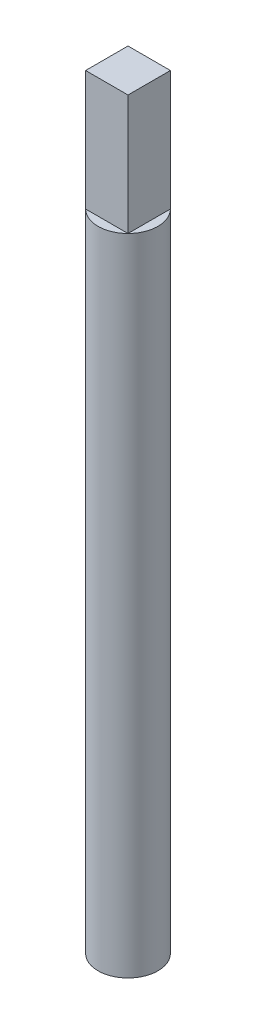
ISO-10303-21;
HEADER;
FILE_DESCRIPTION(('STEP AP214'),'2;1');
FILE_NAME('part.step','',(''),(''),'','','');
FILE_SCHEMA(('AUTOMOTIVE_DESIGN { 1 0 10303 214 1 1 1 1 }'));
ENDSEC;
DATA;
#1=APPLICATION_CONTEXT('core data for automotive mechanical design processes');
#2=APPLICATION_PROTOCOL_DEFINITION('international standard','automotive_design',2000,#1);
#3=PRODUCT_CONTEXT('',#1,'mechanical');
#4=PRODUCT('Part','Part','',(#3));
#5=PRODUCT_RELATED_PRODUCT_CATEGORY('part','',(#4));
#6=PRODUCT_DEFINITION_FORMATION('','',#4);
#7=PRODUCT_DEFINITION_CONTEXT('part definition',#1,'design');
#8=PRODUCT_DEFINITION('design','',#6,#7);
#9=PRODUCT_DEFINITION_SHAPE('','',#8);
#10=(LENGTH_UNIT() NAMED_UNIT(*) SI_UNIT(.MILLI.,.METRE.));
#11=(NAMED_UNIT(*) PLANE_ANGLE_UNIT() SI_UNIT($,.RADIAN.));
#12=(NAMED_UNIT(*) SI_UNIT($,.STERADIAN.) SOLID_ANGLE_UNIT());
#13=UNCERTAINTY_MEASURE_WITH_UNIT(LENGTH_MEASURE(1.E-05),#10,'distance_accuracy_value','');
#14=(GEOMETRIC_REPRESENTATION_CONTEXT(3) GLOBAL_UNCERTAINTY_ASSIGNED_CONTEXT((#13)) GLOBAL_UNIT_ASSIGNED_CONTEXT((#10,
#11,#12)) REPRESENTATION_CONTEXT('',''));
#15=CARTESIAN_POINT('',(0.,0.,0.));
#16=DIRECTION('',(0.,0.,1.));
#17=DIRECTION('',(1.,0.,0.));
#18=AXIS2_PLACEMENT_3D('',#15,#16,#17);
#19=CARTESIAN_POINT('',(2.5,63.75,0.));
#20=DIRECTION('',(0.,-1.,0.));
#21=DIRECTION('',(0.,0.,-1.));
#22=AXIS2_PLACEMENT_3D('',#19,#20,#21);
#23=CYLINDRICAL_SURFACE('',#22,2.5);
#24=CARTESIAN_POINT('',(2.5,3.,0.));
#25=DIRECTION('',(0.,-1.,0.));
#26=DIRECTION('',(0.,0.,-1.));
#27=AXIS2_PLACEMENT_3D('',#24,#25,#26);
#28=CIRCLE('',#27,2.5);
#29=CARTESIAN_POINT('',(0.0505102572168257,3.,0.500000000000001));
#30=VERTEX_POINT('',#29);
#31=CARTESIAN_POINT('',(0.0505102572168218,3.,-0.499999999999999));
#32=VERTEX_POINT('',#31);
#33=EDGE_CURVE('E11',#30,#32,#28,.T.);
#34=ORIENTED_EDGE('',*,*,#33,.F.);
#35=DIRECTION('',(0.,-1.,0.));
#36=VECTOR('',#35,1.);
#37=CARTESIAN_POINT('',(0.0505102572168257,63.75,0.500000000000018));
#38=LINE('',#37,#36);
#39=CARTESIAN_POINT('',(0.0505102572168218,0.,0.5));
#40=VERTEX_POINT('',#39);
#41=EDGE_CURVE('E172',#40,#30,#38,.F.);
#42=ORIENTED_EDGE('',*,*,#41,.F.);
#43=CARTESIAN_POINT('',(2.5,0.,0.));
#44=DIRECTION('',(0.,1.,0.));
#45=DIRECTION('',(0.,0.,1.));
#46=AXIS2_PLACEMENT_3D('',#43,#44,#45);
#47=CIRCLE('',#46,2.5);
#48=CARTESIAN_POINT('',(0.0505102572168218,0.,-0.5));
#49=VERTEX_POINT('',#48);
#50=EDGE_CURVE('E40',#40,#49,#47,.T.);
#51=ORIENTED_EDGE('',*,*,#50,.T.);
#52=DIRECTION('',(0.,-1.,0.));
#53=VECTOR('',#52,1.);
#54=CARTESIAN_POINT('',(0.0505102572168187,63.75,-0.499999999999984));
#55=LINE('',#54,#53);
#56=EDGE_CURVE('E175',#32,#49,#55,.T.);
#57=ORIENTED_EDGE('',*,*,#56,.F.);
#58=EDGE_LOOP('',(#34,#42,#51,#57));
#59=FACE_BOUND('',#58,.T.);
#60=CARTESIAN_POINT('',(2.5,53.75,0.));
#61=DIRECTION('',(0.,1.,0.));
#62=DIRECTION('',(0.,0.,1.));
#63=AXIS2_PLACEMENT_3D('',#60,#61,#62);
#64=CIRCLE('',#63,2.5);
#65=CARTESIAN_POINT('',(0.732233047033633,53.75,1.76776695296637));
#66=VERTEX_POINT('',#65);
#67=CARTESIAN_POINT('',(4.26776695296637,53.75,1.76776695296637));
#68=VERTEX_POINT('',#67);
#69=EDGE_CURVE('E113',#66,#68,#64,.T.);
#70=ORIENTED_EDGE('',*,*,#69,.F.);
#71=CARTESIAN_POINT('',(2.5,53.75,0.));
#72=DIRECTION('',(0.,1.,0.));
#73=DIRECTION('',(0.,0.,1.));
#74=AXIS2_PLACEMENT_3D('',#71,#72,#73);
#75=CIRCLE('',#74,2.5);
#76=CARTESIAN_POINT('',(0.732233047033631,53.75,-1.76776695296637));
#77=VERTEX_POINT('',#76);
#78=EDGE_CURVE('E108',#77,#66,#75,.T.);
#79=ORIENTED_EDGE('',*,*,#78,.F.);
#80=CARTESIAN_POINT('',(2.5,53.75,0.));
#81=DIRECTION('',(0.,1.,0.));
#82=DIRECTION('',(0.,0.,1.));
#83=AXIS2_PLACEMENT_3D('',#80,#81,#82);
#84=CIRCLE('',#83,2.5);
#85=CARTESIAN_POINT('',(4.26776695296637,53.75,-1.76776695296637));
#86=VERTEX_POINT('',#85);
#87=EDGE_CURVE('E130',#86,#77,#84,.T.);
#88=ORIENTED_EDGE('',*,*,#87,.F.);
#89=CARTESIAN_POINT('',(2.5,53.75,0.));
#90=DIRECTION('',(0.,1.,0.));
#91=DIRECTION('',(0.,0.,1.));
#92=AXIS2_PLACEMENT_3D('',#89,#90,#91);
#93=CIRCLE('',#92,2.5);
#94=EDGE_CURVE('E124',#68,#86,#93,.T.);
#95=ORIENTED_EDGE('',*,*,#94,.F.);
#96=EDGE_LOOP('',(#70,#79,#88,#95));
#97=FACE_BOUND('',#96,.T.);
#98=ADVANCED_FACE('F33',(#59,#97),#23,.T.);
#99=CARTESIAN_POINT('',(2.5,63.75,0.));
#100=DIRECTION('',(0.,1.,0.));
#101=DIRECTION('',(0.,0.,1.));
#102=AXIS2_PLACEMENT_3D('',#99,#100,#101);
#103=PLANE('',#102);
#104=DIRECTION('',(0.,0.,1.));
#105=VECTOR('',#104,1.);
#106=CARTESIAN_POINT('',(0.732233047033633,63.75,0.));
#107=LINE('',#106,#105);
#108=CARTESIAN_POINT('',(0.732233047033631,63.75,-1.76776695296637));
#109=VERTEX_POINT('',#108);
#110=CARTESIAN_POINT('',(0.732233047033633,63.75,1.76776695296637));
#111=VERTEX_POINT('',#110);
#112=EDGE_CURVE('E115',#109,#111,#107,.T.);
#113=ORIENTED_EDGE('',*,*,#112,.T.);
#114=DIRECTION('',(1.,0.,0.));
#115=VECTOR('',#114,1.);
#116=CARTESIAN_POINT('',(0.,63.75,1.76776695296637));
#117=LINE('',#116,#115);
#118=CARTESIAN_POINT('',(4.26776695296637,63.75,1.76776695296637));
#119=VERTEX_POINT('',#118);
#120=EDGE_CURVE('E103',#111,#119,#117,.T.);
#121=ORIENTED_EDGE('',*,*,#120,.T.);
#122=DIRECTION('',(0.,0.,1.));
#123=VECTOR('',#122,1.);
#124=CARTESIAN_POINT('',(4.26776695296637,63.75,0.));
#125=LINE('',#124,#123);
#126=CARTESIAN_POINT('',(4.26776695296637,63.75,-1.76776695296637));
#127=VERTEX_POINT('',#126);
#128=EDGE_CURVE('E139',#127,#119,#125,.T.);
#129=ORIENTED_EDGE('',*,*,#128,.F.);
#130=DIRECTION('',(1.,0.,0.));
#131=VECTOR('',#130,1.);
#132=CARTESIAN_POINT('',(0.,63.75,-1.76776695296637));
#133=LINE('',#132,#131);
#134=EDGE_CURVE('E47',#109,#127,#133,.T.);
#135=ORIENTED_EDGE('',*,*,#134,.F.);
#136=EDGE_LOOP('',(#113,#121,#129,#135));
#137=FACE_BOUND('',#136,.T.);
#138=ADVANCED_FACE('F206',(#137),#103,.T.);
#139=CARTESIAN_POINT('',(2.5,0.,0.));
#140=DIRECTION('',(0.,1.,0.));
#141=DIRECTION('',(0.,0.,1.));
#142=AXIS2_PLACEMENT_3D('',#139,#140,#141);
#143=PLANE('',#142);
#144=DIRECTION('',(-1.,0.,0.));
#145=VECTOR('',#144,1.);
#146=CARTESIAN_POINT('',(1.,0.,-0.5));
#147=LINE('',#146,#145);
#148=CARTESIAN_POINT('',(1.,0.,-0.5));
#149=VERTEX_POINT('',#148);
#150=EDGE_CURVE('E161',#149,#49,#147,.T.);
#151=ORIENTED_EDGE('',*,*,#150,.T.);
#152=ORIENTED_EDGE('',*,*,#50,.F.);
#153=DIRECTION('',(-1.,0.,0.));
#154=VECTOR('',#153,1.);
#155=CARTESIAN_POINT('',(1.,0.,0.5));
#156=LINE('',#155,#154);
#157=CARTESIAN_POINT('',(1.,0.,0.5));
#158=VERTEX_POINT('',#157);
#159=EDGE_CURVE('E164',#158,#40,#156,.T.);
#160=ORIENTED_EDGE('',*,*,#159,.F.);
#161=DIRECTION('',(0.,0.,-1.));
#162=VECTOR('',#161,1.);
#163=CARTESIAN_POINT('',(1.,0.,0.5));
#164=LINE('',#163,#162);
#165=EDGE_CURVE('E158',#158,#149,#164,.T.);
#166=ORIENTED_EDGE('',*,*,#165,.T.);
#167=EDGE_LOOP('',(#151,#152,#160,#166));
#168=FACE_BOUND('',#167,.T.);
#169=ADVANCED_FACE('F183',(#168),#143,.F.);
#170=CARTESIAN_POINT('',(1.,3.,0.500000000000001));
#171=DIRECTION('',(0.,-1.,0.));
#172=DIRECTION('',(0.,0.,-1.));
#173=AXIS2_PLACEMENT_3D('',#170,#171,#172);
#174=PLANE('',#173);
#175=DIRECTION('',(-1.,0.,0.));
#176=VECTOR('',#175,1.);
#177=CARTESIAN_POINT('',(1.,3.,0.500000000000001));
#178=LINE('',#177,#176);
#179=CARTESIAN_POINT('',(1.,3.,0.500000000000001));
#180=VERTEX_POINT('',#179);
#181=EDGE_CURVE('E166',#180,#30,#178,.T.);
#182=ORIENTED_EDGE('',*,*,#181,.T.);
#183=ORIENTED_EDGE('',*,*,#33,.T.);
#184=DIRECTION('',(-1.,0.,0.));
#185=VECTOR('',#184,1.);
#186=CARTESIAN_POINT('',(1.,3.,-0.499999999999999));
#187=LINE('',#186,#185);
#188=CARTESIAN_POINT('',(1.,3.,-0.499999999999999));
#189=VERTEX_POINT('',#188);
#190=EDGE_CURVE('E169',#189,#32,#187,.T.);
#191=ORIENTED_EDGE('',*,*,#190,.F.);
#192=DIRECTION('',(0.,0.,1.));
#193=VECTOR('',#192,1.);
#194=CARTESIAN_POINT('',(1.,3.,0.500000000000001));
#195=LINE('',#194,#193);
#196=EDGE_CURVE('E154',#189,#180,#195,.T.);
#197=ORIENTED_EDGE('',*,*,#196,.T.);
#198=EDGE_LOOP('',(#182,#183,#191,#197));
#199=FACE_BOUND('',#198,.T.);
#200=ADVANCED_FACE('F188',(#199),#174,.T.);
#201=CARTESIAN_POINT('',(1.,3.,-0.499999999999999));
#202=DIRECTION('',(0.,0.,1.));
#203=DIRECTION('',(0.,-1.,0.));
#204=AXIS2_PLACEMENT_3D('',#201,#202,#203);
#205=PLANE('',#204);
#206=ORIENTED_EDGE('',*,*,#56,.T.);
#207=ORIENTED_EDGE('',*,*,#150,.F.);
#208=DIRECTION('',(0.,1.,0.));
#209=VECTOR('',#208,1.);
#210=CARTESIAN_POINT('',(1.,3.,-0.499999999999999));
#211=LINE('',#210,#209);
#212=EDGE_CURVE('E55',#149,#189,#211,.T.);
#213=ORIENTED_EDGE('',*,*,#212,.T.);
#214=ORIENTED_EDGE('',*,*,#190,.T.);
#215=EDGE_LOOP('',(#206,#207,#213,#214));
#216=FACE_BOUND('',#215,.T.);
#217=ADVANCED_FACE('F185',(#216),#205,.T.);
#218=CARTESIAN_POINT('',(1.,3.,0.500000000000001));
#219=DIRECTION('',(0.,0.,-1.));
#220=DIRECTION('',(0.,1.,0.));
#221=AXIS2_PLACEMENT_3D('',#218,#219,#220);
#222=PLANE('',#221);
#223=ORIENTED_EDGE('',*,*,#41,.T.);
#224=ORIENTED_EDGE('',*,*,#181,.F.);
#225=DIRECTION('',(0.,-1.,0.));
#226=VECTOR('',#225,1.);
#227=CARTESIAN_POINT('',(1.,3.,0.500000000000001));
#228=LINE('',#227,#226);
#229=EDGE_CURVE('E156',#180,#158,#228,.T.);
#230=ORIENTED_EDGE('',*,*,#229,.T.);
#231=ORIENTED_EDGE('',*,*,#159,.T.);
#232=EDGE_LOOP('',(#223,#224,#230,#231));
#233=FACE_BOUND('',#232,.T.);
#234=ADVANCED_FACE('F191',(#233),#222,.T.);
#235=CARTESIAN_POINT('',(1.,0.,0.));
#236=DIRECTION('',(1.,0.,0.));
#237=DIRECTION('',(0.,0.,-1.));
#238=AXIS2_PLACEMENT_3D('',#235,#236,#237);
#239=PLANE('',#238);
#240=ORIENTED_EDGE('',*,*,#212,.F.);
#241=ORIENTED_EDGE('',*,*,#165,.F.);
#242=ORIENTED_EDGE('',*,*,#229,.F.);
#243=ORIENTED_EDGE('',*,*,#196,.F.);
#244=EDGE_LOOP('',(#240,#241,#242,#243));
#245=FACE_BOUND('',#244,.T.);
#246=ADVANCED_FACE('F193',(#245),#239,.F.);
#247=CARTESIAN_POINT('',(4.26776695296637,53.75,0.));
#248=DIRECTION('',(-1.,0.,0.));
#249=DIRECTION('',(0.,0.,1.));
#250=AXIS2_PLACEMENT_3D('',#247,#248,#249);
#251=PLANE('',#250);
#252=ORIENTED_EDGE('',*,*,#128,.T.);
#253=DIRECTION('',(0.,1.,0.));
#254=VECTOR('',#253,1.);
#255=CARTESIAN_POINT('',(4.26776695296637,53.75,1.76776695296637));
#256=LINE('',#255,#254);
#257=EDGE_CURVE('E150',#68,#119,#256,.T.);
#258=ORIENTED_EDGE('',*,*,#257,.F.);
#259=DIRECTION('',(0.,0.,1.));
#260=VECTOR('',#259,1.);
#261=CARTESIAN_POINT('',(4.26776695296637,53.75,0.));
#262=LINE('',#261,#260);
#263=EDGE_CURVE('E144',#86,#68,#262,.T.);
#264=ORIENTED_EDGE('',*,*,#263,.F.);
#265=DIRECTION('',(0.,1.,0.));
#266=VECTOR('',#265,1.);
#267=CARTESIAN_POINT('',(4.26776695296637,53.75,-1.76776695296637));
#268=LINE('',#267,#266);
#269=EDGE_CURVE('E147',#86,#127,#268,.T.);
#270=ORIENTED_EDGE('',*,*,#269,.T.);
#271=EDGE_LOOP('',(#252,#258,#264,#270));
#272=FACE_BOUND('',#271,.T.);
#273=ADVANCED_FACE('F195',(#272),#251,.F.);
#274=CARTESIAN_POINT('',(0.,53.75,0.));
#275=DIRECTION('',(0.,1.,0.));
#276=DIRECTION('',(0.,0.,1.));
#277=AXIS2_PLACEMENT_3D('',#274,#275,#276);
#278=PLANE('',#277);
#279=ORIENTED_EDGE('',*,*,#94,.T.);
#280=ORIENTED_EDGE('',*,*,#263,.T.);
#281=EDGE_LOOP('',(#279,#280));
#282=FACE_BOUND('',#281,.T.);
#283=ADVANCED_FACE('F201',(#282),#278,.T.);
#284=CARTESIAN_POINT('',(0.,53.75,-1.76776695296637));
#285=DIRECTION('',(0.,0.,1.));
#286=DIRECTION('',(1.,0.,0.));
#287=AXIS2_PLACEMENT_3D('',#284,#285,#286);
#288=PLANE('',#287);
#289=ORIENTED_EDGE('',*,*,#134,.T.);
#290=ORIENTED_EDGE('',*,*,#269,.F.);
#291=DIRECTION('',(1.,0.,0.));
#292=VECTOR('',#291,1.);
#293=CARTESIAN_POINT('',(0.,53.75,-1.76776695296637));
#294=LINE('',#293,#292);
#295=EDGE_CURVE('E137',#77,#86,#294,.T.);
#296=ORIENTED_EDGE('',*,*,#295,.F.);
#297=DIRECTION('',(0.,1.,0.));
#298=VECTOR('',#297,1.);
#299=CARTESIAN_POINT('',(0.732233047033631,53.75,-1.76776695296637));
#300=LINE('',#299,#298);
#301=EDGE_CURVE('E128',#77,#109,#300,.T.);
#302=ORIENTED_EDGE('',*,*,#301,.T.);
#303=EDGE_LOOP('',(#289,#290,#296,#302));
#304=FACE_BOUND('',#303,.T.);
#305=ADVANCED_FACE('F258',(#304),#288,.F.);
#306=CARTESIAN_POINT('',(0.,53.75,0.));
#307=DIRECTION('',(0.,1.,0.));
#308=DIRECTION('',(0.,0.,1.));
#309=AXIS2_PLACEMENT_3D('',#306,#307,#308);
#310=PLANE('',#309);
#311=ORIENTED_EDGE('',*,*,#87,.T.);
#312=ORIENTED_EDGE('',*,*,#295,.T.);
#313=EDGE_LOOP('',(#311,#312));
#314=FACE_BOUND('',#313,.T.);
#315=ADVANCED_FACE('F268',(#314),#310,.T.);
#316=CARTESIAN_POINT('',(0.732233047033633,53.75,0.));
#317=DIRECTION('',(-1.,0.,0.));
#318=DIRECTION('',(0.,0.,1.));
#319=AXIS2_PLACEMENT_3D('',#316,#317,#318);
#320=PLANE('',#319);
#321=ORIENTED_EDGE('',*,*,#112,.F.);
#322=ORIENTED_EDGE('',*,*,#301,.F.);
#323=DIRECTION('',(0.,0.,1.));
#324=VECTOR('',#323,1.);
#325=CARTESIAN_POINT('',(0.732233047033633,53.75,0.));
#326=LINE('',#325,#324);
#327=EDGE_CURVE('E107',#77,#66,#326,.T.);
#328=ORIENTED_EDGE('',*,*,#327,.T.);
#329=DIRECTION('',(0.,1.,0.));
#330=VECTOR('',#329,1.);
#331=CARTESIAN_POINT('',(0.732233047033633,53.75,1.76776695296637));
#332=LINE('',#331,#330);
#333=EDGE_CURVE('E97',#66,#111,#332,.T.);
#334=ORIENTED_EDGE('',*,*,#333,.T.);
#335=EDGE_LOOP('',(#321,#322,#328,#334));
#336=FACE_BOUND('',#335,.T.);
#337=ADVANCED_FACE('F127',(#336),#320,.T.);
#338=CARTESIAN_POINT('',(0.,53.75,0.));
#339=DIRECTION('',(0.,1.,0.));
#340=DIRECTION('',(0.,0.,1.));
#341=AXIS2_PLACEMENT_3D('',#338,#339,#340);
#342=PLANE('',#341);
#343=ORIENTED_EDGE('',*,*,#327,.F.);
#344=ORIENTED_EDGE('',*,*,#78,.T.);
#345=EDGE_LOOP('',(#343,#344));
#346=FACE_BOUND('',#345,.T.);
#347=ADVANCED_FACE('F132',(#346),#342,.T.);
#348=CARTESIAN_POINT('',(0.,53.75,1.76776695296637));
#349=DIRECTION('',(0.,0.,1.));
#350=DIRECTION('',(1.,0.,0.));
#351=AXIS2_PLACEMENT_3D('',#348,#349,#350);
#352=PLANE('',#351);
#353=ORIENTED_EDGE('',*,*,#120,.F.);
#354=ORIENTED_EDGE('',*,*,#333,.F.);
#355=DIRECTION('',(1.,0.,0.));
#356=VECTOR('',#355,1.);
#357=CARTESIAN_POINT('',(0.,53.75,1.76776695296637));
#358=LINE('',#357,#356);
#359=EDGE_CURVE('E100',#66,#68,#358,.T.);
#360=ORIENTED_EDGE('',*,*,#359,.T.);
#361=ORIENTED_EDGE('',*,*,#257,.T.);
#362=EDGE_LOOP('',(#353,#354,#360,#361));
#363=FACE_BOUND('',#362,.T.);
#364=ADVANCED_FACE('F99',(#363),#352,.T.);
#365=CARTESIAN_POINT('',(0.,53.75,0.));
#366=DIRECTION('',(0.,1.,0.));
#367=DIRECTION('',(0.,0.,1.));
#368=AXIS2_PLACEMENT_3D('',#365,#366,#367);
#369=PLANE('',#368);
#370=ORIENTED_EDGE('',*,*,#359,.F.);
#371=ORIENTED_EDGE('',*,*,#69,.T.);
#372=EDGE_LOOP('',(#370,#371));
#373=FACE_BOUND('',#372,.T.);
#374=ADVANCED_FACE('F112',(#373),#369,.T.);
#375=CLOSED_SHELL('',(#98,#138,#169,#200,#217,#234,#246,#273,#283,#305,#315,#337,#347,#364,#374));
#376=MANIFOLD_SOLID_BREP('B2',#375);
#377=ADVANCED_BREP_SHAPE_REPRESENTATION('',(#18,#376),#14);
#378=SHAPE_DEFINITION_REPRESENTATION(#9,#377);
ENDSEC;
END-ISO-10303-21;
